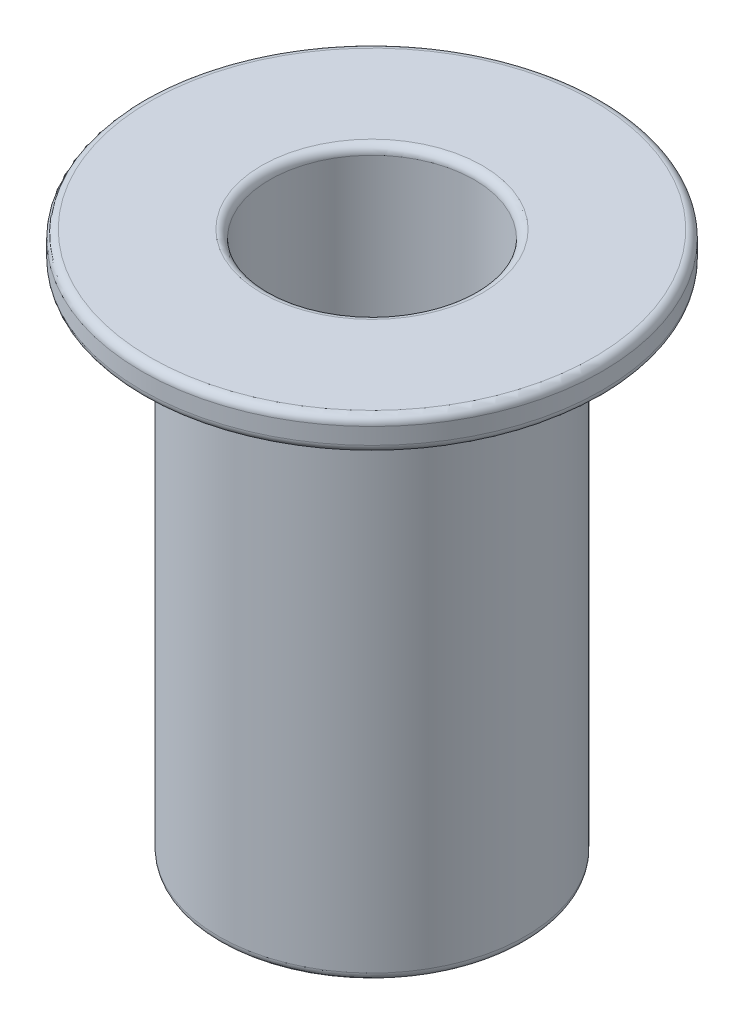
from build123d import *

# Parameters (mm, degrees)
SKETCH1_R                        = 7.14375
BASE_EXTRUDE_DEPTH               = 1.016
SKETCH2_R                        = 4.7625
BOSS_EXTRUDE1_DEPTH              = 15.875
SKETCH3_R                        = 3.175
CUT_EXTRUDE1_DEPTH               = 9.525
F_10_32_TAPPED_HOLE1_D           = 4.0386
F_10_32_TAPPED_HOLE1_CBORE_D     = 4.826
F_10_32_TAPPED_HOLE1_CBORE_DEPTH = 9.652
FILLET1_R                        = 0.254


with BuildPart() as part:
    # Sketch1 → Base-Extrude (new body)
    with BuildSketch(Plane(origin=(0, 0, 0), x_dir=(1, 0, 0), z_dir=(0, 1, 0))):
        with Locations(Location((0, 0, 0), (0, 0, 270))):
            Circle(SKETCH1_R)
    extrude(amount=BASE_EXTRUDE_DEPTH)

    # Sketch2 → Boss-Extrude1 (add)
    with BuildSketch(Plane.XZ):
        with Locations(Location((0, 0, 0), (0, 0, 90))):
            Circle(SKETCH2_R)
    extrude(amount=BOSS_EXTRUDE1_DEPTH)

    # Sketch3 → Cut-Extrude1 (cut)
    with BuildSketch(Plane(origin=(0, 1.016, 0), x_dir=(-1, 0, 0), z_dir=(0, 1, 0))):
        with Locations(Location((0, 0, 0), (0, 0, 90))):
            Circle(SKETCH3_R)
    extrude(amount=-CUT_EXTRUDE1_DEPTH, mode=Mode.SUBTRACT)

    # 10-32 Tapped Hole1 (through all)
    with Locations(Plane(origin=(0, -8.509, 0), x_dir=(-1, 0, 0), z_dir=(0, 1, 0))):
        with Locations((0, 0)):
            CounterBoreHole(F_10_32_TAPPED_HOLE1_D / 2, F_10_32_TAPPED_HOLE1_CBORE_D / 2, F_10_32_TAPPED_HOLE1_CBORE_DEPTH)

    # Fillet1
    fillet1_edges = [part.edges().sort_by_distance(p)[0] for p in [
        (0, 0, -7.14375),
        (0, 1.016, -7.14375),
        (0, 0, -4.7625),
        (0, 1.016, -3.175),
        (0, -15.875, -4.7625),
    ]]
    fillet(fillet1_edges, radius=FILLET1_R)


solid = part.part
